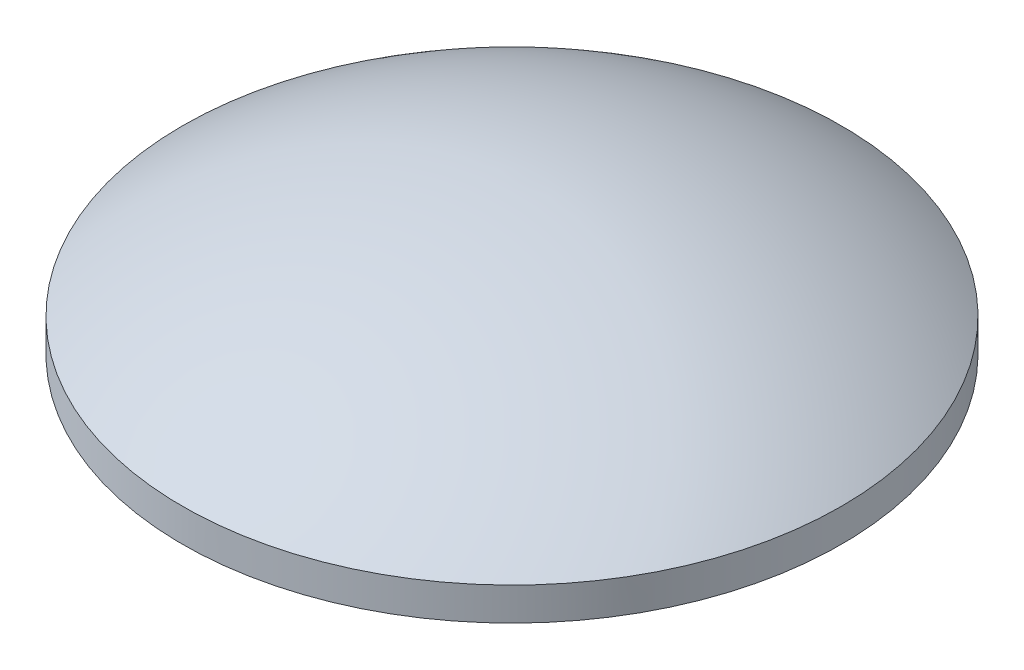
from build123d import *


with BuildPart() as part:
    # Esquisse1 → Base-R_volution (revolve)
    with BuildSketch(Plane.XY):
        with BuildLine():
            Line((-12, 8), (-12, 6))
            ThreePointArc((-12, 6), (-21.327379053, 4.513154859), (-29.730200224, 0.2))
            Line((-29.730200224, 0.2), (-30, 0.2))
            Line((-30, 0.2), (-30, 2))
            ThreePointArc((-30, 2), (-21.486832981, 6.460498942), (-12, 8))
        make_face()
    revolve(axis=Axis((-12, 70, 0), (0, -1, 0)))


solid = part.part
